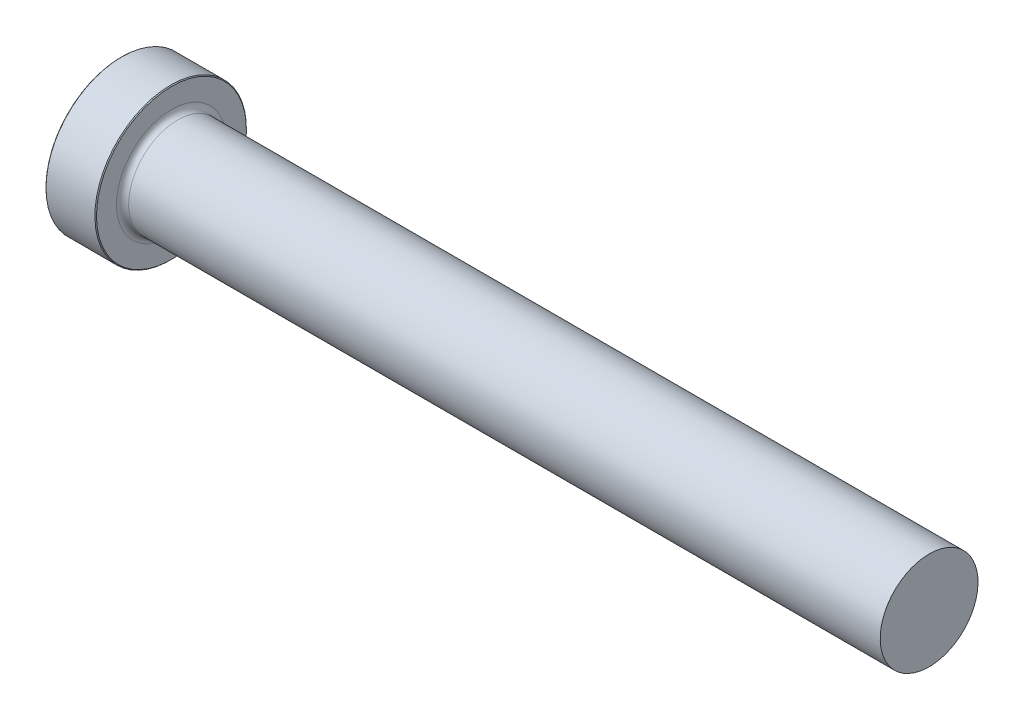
from build123d import *

# Parameters (mm, degrees)
CHAMFER1_SIZE = 0.1016


with BuildPart() as part:
    # Sketch1 → Revolve1 (revolve)
    with BuildSketch(Plane.XY):
        with BuildLine():
            Line((0, 0), (0, 9.525))
            Line((0, 9.525), (6.35, 9.525))
            Line((6.35, 9.525), (6.35, 6.9097525))
            ThreePointArc((6.35, 6.9097525), (6.573184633, 6.370937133), (7.112, 6.1477525))
            Line((7.112, 6.1477525), (101.6, 6.1477525))
            Line((101.6, 6.1477525), (101.6, 0))
            Line((101.6, 0), (0, 0))
        make_face()
    revolve(axis=Axis((101.6, 0, 0), (-1, 0, 0)))

    # Chamfer1
    chamfer1_edges = [part.edges().sort_by_distance(p)[0] for p in [
        (0, -9.525, 0),
        (6.35, -9.525, 0),
    ]]
    chamfer(chamfer1_edges, length=CHAMFER1_SIZE)


solid = part.part
